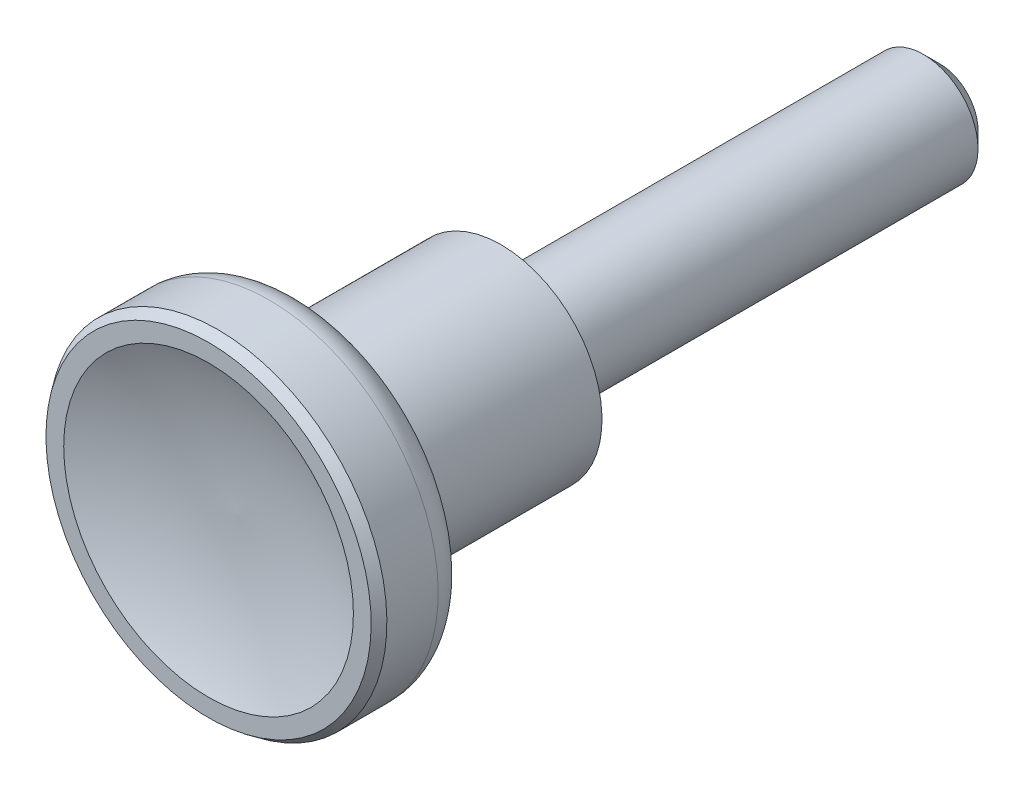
ISO-10303-21;
HEADER;
FILE_DESCRIPTION(('STEP AP214'),'2;1');
FILE_NAME('part.step','',(''),(''),'','','');
FILE_SCHEMA(('AUTOMOTIVE_DESIGN { 1 0 10303 214 1 1 1 1 }'));
ENDSEC;
DATA;
#1=APPLICATION_CONTEXT('core data for automotive mechanical design processes');
#2=APPLICATION_PROTOCOL_DEFINITION('international standard','automotive_design',2000,#1);
#3=PRODUCT_CONTEXT('',#1,'mechanical');
#4=PRODUCT('Part','Part','',(#3));
#5=PRODUCT_RELATED_PRODUCT_CATEGORY('part','',(#4));
#6=PRODUCT_DEFINITION_FORMATION('','',#4);
#7=PRODUCT_DEFINITION_CONTEXT('part definition',#1,'design');
#8=PRODUCT_DEFINITION('design','',#6,#7);
#9=PRODUCT_DEFINITION_SHAPE('','',#8);
#10=(LENGTH_UNIT() NAMED_UNIT(*) SI_UNIT(.MILLI.,.METRE.));
#11=(NAMED_UNIT(*) PLANE_ANGLE_UNIT() SI_UNIT($,.RADIAN.));
#12=(NAMED_UNIT(*) SI_UNIT($,.STERADIAN.) SOLID_ANGLE_UNIT());
#13=UNCERTAINTY_MEASURE_WITH_UNIT(LENGTH_MEASURE(1.E-05),#10,'distance_accuracy_value','');
#14=(GEOMETRIC_REPRESENTATION_CONTEXT(3) GLOBAL_UNCERTAINTY_ASSIGNED_CONTEXT((#13)) GLOBAL_UNIT_ASSIGNED_CONTEXT((#10,
#11,#12)) REPRESENTATION_CONTEXT('',''));
#15=CARTESIAN_POINT('',(0.,0.,0.));
#16=DIRECTION('',(0.,0.,1.));
#17=DIRECTION('',(1.,0.,0.));
#18=AXIS2_PLACEMENT_3D('',#15,#16,#17);
#19=CARTESIAN_POINT('',(9.25,0.,0.200000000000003));
#20=DIRECTION('',(0.,0.,1.));
#21=DIRECTION('',(0.,-1.,0.));
#22=AXIS2_PLACEMENT_3D('',#19,#20,#21);
#23=PLANE('',#22);
#24=CARTESIAN_POINT('',(0.,0.,0.200000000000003));
#25=DIRECTION('',(0.,0.,-1.));
#26=DIRECTION('',(0.,1.,0.));
#27=AXIS2_PLACEMENT_3D('',#24,#25,#26);
#28=CIRCLE('',#27,6.);
#29=CARTESIAN_POINT('',(0.,6.,0.200000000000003));
#30=VERTEX_POINT('',#29);
#31=EDGE_CURVE('E129',#30,#30,#28,.T.);
#32=ORIENTED_EDGE('',*,*,#31,.F.);
#33=EDGE_LOOP('',(#32));
#34=FACE_BOUND('',#33,.T.);
#35=CARTESIAN_POINT('',(0.,0.,0.200000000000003));
#36=DIRECTION('',(0.,0.,-1.));
#37=DIRECTION('',(0.,1.,0.));
#38=AXIS2_PLACEMENT_3D('',#35,#36,#37);
#39=CIRCLE('',#38,9.25);
#40=CARTESIAN_POINT('',(0.,9.25,0.200000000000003));
#41=VERTEX_POINT('',#40);
#42=EDGE_CURVE('E104',#41,#41,#39,.T.);
#43=ORIENTED_EDGE('',*,*,#42,.T.);
#44=EDGE_LOOP('',(#43));
#45=FACE_BOUND('',#44,.T.);
#46=ADVANCED_FACE('F14',(#34,#45),#23,.F.);
#47=CARTESIAN_POINT('',(0.,0.,-5.03212408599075));
#48=DIRECTION('',(0.,0.,-1.));
#49=DIRECTION('',(0.,1.,0.));
#50=AXIS2_PLACEMENT_3D('',#47,#48,#49);
#51=CYLINDRICAL_SURFACE('',#50,9.25);
#52=CARTESIAN_POINT('',(0.,0.,17.));
#53=DIRECTION('',(0.,0.,-1.));
#54=DIRECTION('',(0.,1.,0.));
#55=AXIS2_PLACEMENT_3D('',#52,#53,#54);
#56=CIRCLE('',#55,9.25);
#57=CARTESIAN_POINT('',(0.,9.25,17.));
#58=VERTEX_POINT('',#57);
#59=EDGE_CURVE('E101',#58,#58,#56,.T.);
#60=ORIENTED_EDGE('',*,*,#59,.T.);
#61=EDGE_LOOP('',(#60));
#62=FACE_BOUND('',#61,.T.);
#63=ORIENTED_EDGE('',*,*,#42,.F.);
#64=EDGE_LOOP('',(#63));
#65=FACE_BOUND('',#64,.T.);
#66=ADVANCED_FACE('F44',(#62,#65),#51,.T.);
#67=CARTESIAN_POINT('',(0.,0.,16.8985536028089));
#68=DIRECTION('',(0.,0.,-1.));
#69=DIRECTION('',(0.,1.,0.));
#70=AXIS2_PLACEMENT_3D('',#67,#68,#69);
#71=TOROIDAL_SURFACE('',#70,10.0001743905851,0.757002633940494);
#72=ORIENTED_EDGE('',*,*,#59,.F.);
#73=EDGE_LOOP('',(#72));
#74=FACE_BOUND('',#73,.T.);
#75=CARTESIAN_POINT('',(0.,0.,17.6315572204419));
#76=DIRECTION('',(0.,0.,-1.));
#77=DIRECTION('',(0.,1.,0.));
#78=AXIS2_PLACEMENT_3D('',#75,#76,#77);
#79=CIRCLE('',#78,9.81107472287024);
#80=CARTESIAN_POINT('',(0.,9.81107472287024,17.6315572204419));
#81=VERTEX_POINT('',#80);
#82=EDGE_CURVE('E98',#81,#81,#79,.T.);
#83=ORIENTED_EDGE('',*,*,#82,.T.);
#84=EDGE_LOOP('',(#83));
#85=FACE_BOUND('',#84,.T.);
#86=ADVANCED_FACE('F50',(#74,#85),#71,.F.);
#87=CARTESIAN_POINT('',(0.,0.,17.6315572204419));
#88=DIRECTION('',(0.,0.,1.));
#89=DIRECTION('',(0.,-1.,0.));
#90=AXIS2_PLACEMENT_3D('',#87,#88,#89);
#91=CONICAL_SURFACE('',#90,9.81107472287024,1.30899528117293);
#92=CARTESIAN_POINT('',(0.,0.,18.5601110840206));
#93=DIRECTION('',(0.,0.,-1.));
#94=DIRECTION('',(0.,1.,0.));
#95=AXIS2_PLACEMENT_3D('',#92,#93,#94);
#96=CIRCLE('',#95,13.2764619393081);
#97=CARTESIAN_POINT('',(0.,13.2764619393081,18.5601110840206));
#98=VERTEX_POINT('',#97);
#99=EDGE_CURVE('E95',#98,#98,#96,.T.);
#100=ORIENTED_EDGE('',*,*,#99,.T.);
#101=EDGE_LOOP('',(#100));
#102=FACE_BOUND('',#101,.T.);
#103=ORIENTED_EDGE('',*,*,#82,.F.);
#104=EDGE_LOOP('',(#103));
#105=FACE_BOUND('',#104,.T.);
#106=ADVANCED_FACE('F58',(#102,#105),#91,.T.);
#107=CARTESIAN_POINT('',(0.,0.,21.4578872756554));
#108=DIRECTION('',(0.,0.,-1.));
#109=DIRECTION('',(0.,1.,0.));
#110=AXIS2_PLACEMENT_3D('',#107,#108,#109);
#111=TOROIDAL_SURFACE('',#110,12.5,3.);
#112=CARTESIAN_POINT('',(0.,0.,21.4578872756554));
#113=DIRECTION('',(0.,0.,-1.));
#114=DIRECTION('',(0.,1.,0.));
#115=AXIS2_PLACEMENT_3D('',#112,#113,#114);
#116=CIRCLE('',#115,15.5);
#117=CARTESIAN_POINT('',(0.,15.5,21.4578872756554));
#118=VERTEX_POINT('',#117);
#119=EDGE_CURVE('E86',#118,#118,#116,.T.);
#120=ORIENTED_EDGE('',*,*,#119,.T.);
#121=EDGE_LOOP('',(#120));
#122=FACE_BOUND('',#121,.T.);
#123=ORIENTED_EDGE('',*,*,#99,.F.);
#124=EDGE_LOOP('',(#123));
#125=FACE_BOUND('',#124,.T.);
#126=ADVANCED_FACE('F62',(#122,#125),#111,.T.);
#127=CARTESIAN_POINT('',(0.,0.,-5.03212408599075));
#128=DIRECTION('',(0.,0.,-1.));
#129=DIRECTION('',(0.,1.,0.));
#130=AXIS2_PLACEMENT_3D('',#127,#128,#129);
#131=CYLINDRICAL_SURFACE('',#130,15.5);
#132=CARTESIAN_POINT('',(0.,0.,26.1604195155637));
#133=DIRECTION('',(0.,0.,-1.));
#134=DIRECTION('',(0.,1.,0.));
#135=AXIS2_PLACEMENT_3D('',#132,#133,#134);
#136=CIRCLE('',#135,15.5);
#137=CARTESIAN_POINT('',(0.,15.5,26.1604195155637));
#138=VERTEX_POINT('',#137);
#139=EDGE_CURVE('E79',#138,#138,#136,.T.);
#140=ORIENTED_EDGE('',*,*,#139,.T.);
#141=EDGE_LOOP('',(#140));
#142=FACE_BOUND('',#141,.T.);
#143=ORIENTED_EDGE('',*,*,#119,.F.);
#144=EDGE_LOOP('',(#143));
#145=FACE_BOUND('',#144,.T.);
#146=ADVANCED_FACE('F66',(#142,#145),#131,.T.);
#147=CARTESIAN_POINT('',(0.,0.,27.));
#148=DIRECTION('',(0.,0.,-1.));
#149=DIRECTION('',(0.,1.,0.));
#150=AXIS2_PLACEMENT_3D('',#147,#148,#149);
#151=CONICAL_SURFACE('',#150,14.8985964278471,0.621591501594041);
#152=ORIENTED_EDGE('',*,*,#139,.F.);
#153=EDGE_LOOP('',(#152));
#154=FACE_BOUND('',#153,.T.);
#155=CARTESIAN_POINT('',(0.,0.,27.));
#156=DIRECTION('',(0.,0.,-1.));
#157=DIRECTION('',(0.,1.,0.));
#158=AXIS2_PLACEMENT_3D('',#155,#156,#157);
#159=CIRCLE('',#158,14.8985964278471);
#160=CARTESIAN_POINT('',(0.,14.8985964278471,27.));
#161=VERTEX_POINT('',#160);
#162=EDGE_CURVE('E82',#161,#161,#159,.T.);
#163=ORIENTED_EDGE('',*,*,#162,.T.);
#164=EDGE_LOOP('',(#163));
#165=FACE_BOUND('',#164,.T.);
#166=ADVANCED_FACE('F39',(#154,#165),#151,.T.);
#167=CARTESIAN_POINT('',(14.8985964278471,0.,27.));
#168=DIRECTION('',(0.,0.,1.));
#169=DIRECTION('',(0.,-1.,0.));
#170=AXIS2_PLACEMENT_3D('',#167,#168,#169);
#171=PLANE('',#170);
#172=CARTESIAN_POINT('',(0.,0.,27.));
#173=DIRECTION('',(0.,0.,-1.));
#174=DIRECTION('',(0.,1.,0.));
#175=AXIS2_PLACEMENT_3D('',#172,#173,#174);
#176=CIRCLE('',#175,13.2712747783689);
#177=CARTESIAN_POINT('',(0.,13.2712747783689,27.));
#178=VERTEX_POINT('',#177);
#179=EDGE_CURVE('E84',#178,#178,#176,.T.);
#180=ORIENTED_EDGE('',*,*,#179,.T.);
#181=EDGE_LOOP('',(#180));
#182=FACE_BOUND('',#181,.T.);
#183=ORIENTED_EDGE('',*,*,#162,.F.);
#184=EDGE_LOOP('',(#183));
#185=FACE_BOUND('',#184,.T.);
#186=ADVANCED_FACE('F27',(#182,#185),#171,.T.);
#187=CARTESIAN_POINT('',(0.,1.00000000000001,54.4628043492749));
#188=DIRECTION('',(-1.,0.,0.));
#189=DIRECTION('',(0.,1.,0.));
#190=AXIS2_PLACEMENT_3D('',#187,#188,#189);
#191=CIRCLE('',#190,30.0797241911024);
#192=TRIMMED_CURVE('',#191,(PARAMETER_VALUE(-1.60404743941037)),
(PARAMETER_VALUE(1.60404743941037)),.T.,.PARAMETER.);
#193=CARTESIAN_POINT('',(0.,0.,54.4628043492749));
#194=DIRECTION('',(0.,0.,-1.));
#195=AXIS1_PLACEMENT('',#193,#194);
#196=SURFACE_OF_REVOLUTION('',#192,#195);
#197=ORIENTED_EDGE('',*,*,#179,.F.);
#198=EDGE_LOOP('',(#197));
#199=FACE_BOUND('',#198,.T.);
#200=CARTESIAN_POINT('',(0.,0.,24.3997072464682));
#201=VERTEX_POINT('',#200);
#202=VERTEX_LOOP('',#201);
#203=FACE_BOUND('',#202,.T.);
#204=ADVANCED_FACE('F24',(#199,#203),#196,.F.);
#205=CARTESIAN_POINT('',(4.99999999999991,0.,-40.));
#206=DIRECTION('',(0.,0.,1.));
#207=DIRECTION('',(0.,-1.,0.));
#208=AXIS2_PLACEMENT_3D('',#205,#206,#207);
#209=PLANE('',#208);
#210=CARTESIAN_POINT('',(0.,0.,-40.));
#211=DIRECTION('',(0.,0.,1.));
#212=DIRECTION('',(1.,0.,0.));
#213=AXIS2_PLACEMENT_3D('',#210,#211,#212);
#214=CIRCLE('',#213,3.5);
#215=CARTESIAN_POINT('',(3.5,0.,-40.));
#216=VERTEX_POINT('',#215);
#217=EDGE_CURVE('E21',#216,#216,#214,.F.);
#218=ORIENTED_EDGE('',*,*,#217,.T.);
#219=EDGE_LOOP('',(#218));
#220=FACE_BOUND('',#219,.T.);
#221=ADVANCED_FACE('F26',(#220),#209,.F.);
#222=CARTESIAN_POINT('',(0.,0.,-5.03212408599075));
#223=DIRECTION('',(0.,0.,-1.));
#224=DIRECTION('',(0.,1.,0.));
#225=AXIS2_PLACEMENT_3D('',#222,#223,#224);
#226=CYLINDRICAL_SURFACE('',#225,5.);
#227=CARTESIAN_POINT('',(0.,0.,-38.5));
#228=DIRECTION('',(0.,0.,1.));
#229=DIRECTION('',(1.,0.,0.));
#230=AXIS2_PLACEMENT_3D('',#227,#228,#229);
#231=CIRCLE('',#230,5.);
#232=CARTESIAN_POINT('',(5.,0.,-38.5));
#233=VERTEX_POINT('',#232);
#234=EDGE_CURVE('E9',#233,#233,#231,.T.);
#235=ORIENTED_EDGE('',*,*,#234,.T.);
#236=EDGE_LOOP('',(#235));
#237=FACE_BOUND('',#236,.T.);
#238=CARTESIAN_POINT('',(0.,0.,0.));
#239=DIRECTION('',(0.,0.,-1.));
#240=DIRECTION('',(0.,1.,0.));
#241=AXIS2_PLACEMENT_3D('',#238,#239,#240);
#242=CIRCLE('',#241,5.);
#243=CARTESIAN_POINT('',(0.,5.,0.));
#244=VERTEX_POINT('',#243);
#245=EDGE_CURVE('E89',#244,#244,#242,.T.);
#246=ORIENTED_EDGE('',*,*,#245,.T.);
#247=EDGE_LOOP('',(#246));
#248=FACE_BOUND('',#247,.T.);
#249=ADVANCED_FACE('F36',(#237,#248),#226,.T.);
#250=CARTESIAN_POINT('',(5.99999999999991,0.,0.));
#251=DIRECTION('',(0.,0.,1.));
#252=DIRECTION('',(0.,-1.,0.));
#253=AXIS2_PLACEMENT_3D('',#250,#251,#252);
#254=PLANE('',#253);
#255=ORIENTED_EDGE('',*,*,#245,.F.);
#256=EDGE_LOOP('',(#255));
#257=FACE_BOUND('',#256,.T.);
#258=CARTESIAN_POINT('',(0.,0.,0.));
#259=DIRECTION('',(0.,0.,-1.));
#260=DIRECTION('',(0.,1.,0.));
#261=AXIS2_PLACEMENT_3D('',#258,#259,#260);
#262=CIRCLE('',#261,6.);
#263=CARTESIAN_POINT('',(0.,6.,0.));
#264=VERTEX_POINT('',#263);
#265=EDGE_CURVE('E127',#264,#264,#262,.T.);
#266=ORIENTED_EDGE('',*,*,#265,.T.);
#267=EDGE_LOOP('',(#266));
#268=FACE_BOUND('',#267,.T.);
#269=ADVANCED_FACE('F116',(#257,#268),#254,.F.);
#270=CARTESIAN_POINT('',(0.,0.,-5.03212408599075));
#271=DIRECTION('',(0.,0.,-1.));
#272=DIRECTION('',(0.,1.,0.));
#273=AXIS2_PLACEMENT_3D('',#270,#271,#272);
#274=CYLINDRICAL_SURFACE('',#273,6.);
#275=ORIENTED_EDGE('',*,*,#265,.F.);
#276=EDGE_LOOP('',(#275));
#277=FACE_BOUND('',#276,.T.);
#278=ORIENTED_EDGE('',*,*,#31,.T.);
#279=EDGE_LOOP('',(#278));
#280=FACE_BOUND('',#279,.T.);
#281=ADVANCED_FACE('F110',(#277,#280),#274,.T.);
#282=CARTESIAN_POINT('',(0.,0.,-40.));
#283=DIRECTION('',(0.,0.,1.));
#284=DIRECTION('',(1.,0.,0.));
#285=AXIS2_PLACEMENT_3D('',#282,#283,#284);
#286=CONICAL_SURFACE('',#285,3.5,0.785398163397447);
#287=ORIENTED_EDGE('',*,*,#234,.F.);
#288=EDGE_LOOP('',(#287));
#289=FACE_BOUND('',#288,.T.);
#290=ORIENTED_EDGE('',*,*,#217,.F.);
#291=EDGE_LOOP('',(#290));
#292=FACE_BOUND('',#291,.T.);
#293=ADVANCED_FACE('F16',(#289,#292),#286,.T.);
#294=CLOSED_SHELL('',(#46,#66,#86,#106,#126,#146,#166,#186,#204,#221,#249,#269,#281,#293));
#295=MANIFOLD_SOLID_BREP('B1',#294);
#296=ADVANCED_BREP_SHAPE_REPRESENTATION('',(#18,#295),#14);
#297=SHAPE_DEFINITION_REPRESENTATION(#9,#296);
ENDSEC;
END-ISO-10303-21;
